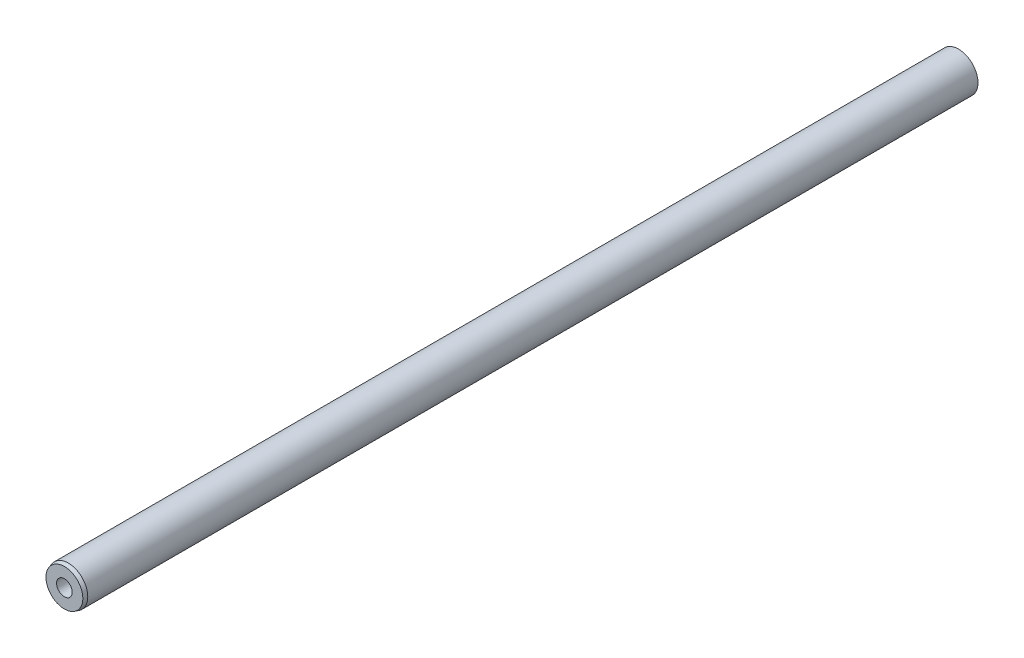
ISO-10303-21;
HEADER;
FILE_DESCRIPTION(('STEP AP214'),'2;1');
FILE_NAME('part.step','',(''),(''),'','','');
FILE_SCHEMA(('AUTOMOTIVE_DESIGN { 1 0 10303 214 1 1 1 1 }'));
ENDSEC;
DATA;
#1=APPLICATION_CONTEXT('core data for automotive mechanical design processes');
#2=APPLICATION_PROTOCOL_DEFINITION('international standard','automotive_design',2000,#1);
#3=PRODUCT_CONTEXT('',#1,'mechanical');
#4=PRODUCT('Part','Part','',(#3));
#5=PRODUCT_RELATED_PRODUCT_CATEGORY('part','',(#4));
#6=PRODUCT_DEFINITION_FORMATION('','',#4);
#7=PRODUCT_DEFINITION_CONTEXT('part definition',#1,'design');
#8=PRODUCT_DEFINITION('design','',#6,#7);
#9=PRODUCT_DEFINITION_SHAPE('','',#8);
#10=(LENGTH_UNIT() NAMED_UNIT(*) SI_UNIT(.MILLI.,.METRE.));
#11=(NAMED_UNIT(*) PLANE_ANGLE_UNIT() SI_UNIT($,.RADIAN.));
#12=(NAMED_UNIT(*) SI_UNIT($,.STERADIAN.) SOLID_ANGLE_UNIT());
#13=UNCERTAINTY_MEASURE_WITH_UNIT(LENGTH_MEASURE(1.E-05),#10,'distance_accuracy_value','');
#14=(GEOMETRIC_REPRESENTATION_CONTEXT(3) GLOBAL_UNCERTAINTY_ASSIGNED_CONTEXT((#13)) GLOBAL_UNIT_ASSIGNED_CONTEXT((#10,
#11,#12)) REPRESENTATION_CONTEXT('',''));
#15=CARTESIAN_POINT('',(0.,0.,0.));
#16=DIRECTION('',(0.,0.,1.));
#17=DIRECTION('',(1.,0.,0.));
#18=AXIS2_PLACEMENT_3D('',#15,#16,#17);
#19=CARTESIAN_POINT('',(0.,0.,291.4904));
#20=DIRECTION('',(0.,0.,-1.));
#21=DIRECTION('',(-1.,0.,0.));
#22=AXIS2_PLACEMENT_3D('',#19,#20,#21);
#23=CYLINDRICAL_SURFACE('',#22,6.34999999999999);
#24=CARTESIAN_POINT('',(0.,0.,290.2204));
#25=DIRECTION('',(0.,0.,1.));
#26=DIRECTION('',(1.,0.,0.));
#27=AXIS2_PLACEMENT_3D('',#24,#25,#26);
#28=CIRCLE('',#27,6.34999999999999);
#29=CARTESIAN_POINT('',(6.34999999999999,0.,290.2204));
#30=VERTEX_POINT('',#29);
#31=EDGE_CURVE('E11',#30,#30,#28,.F.);
#32=ORIENTED_EDGE('',*,*,#31,.T.);
#33=EDGE_LOOP('',(#32));
#34=FACE_BOUND('',#33,.T.);
#35=CARTESIAN_POINT('',(0.,0.,0.));
#36=DIRECTION('',(0.,0.,1.));
#37=DIRECTION('',(1.,0.,0.));
#38=AXIS2_PLACEMENT_3D('',#35,#36,#37);
#39=CIRCLE('',#38,6.34999999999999);
#40=CARTESIAN_POINT('',(6.34999999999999,0.,0.));
#41=VERTEX_POINT('',#40);
#42=EDGE_CURVE('E67',#41,#41,#39,.T.);
#43=ORIENTED_EDGE('',*,*,#42,.T.);
#44=EDGE_LOOP('',(#43));
#45=FACE_BOUND('',#44,.T.);
#46=ADVANCED_FACE('F45',(#34,#45),#23,.T.);
#47=CARTESIAN_POINT('',(0.,0.,291.4904));
#48=DIRECTION('',(0.,0.,1.));
#49=DIRECTION('',(1.,0.,0.));
#50=AXIS2_PLACEMENT_3D('',#47,#48,#49);
#51=PLANE('',#50);
#52=CARTESIAN_POINT('',(0.,0.,291.4904));
#53=DIRECTION('',(0.,0.,1.));
#54=DIRECTION('',(1.,0.,0.));
#55=AXIS2_PLACEMENT_3D('',#52,#53,#54);
#56=CIRCLE('',#55,2.552697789);
#57=CARTESIAN_POINT('',(2.552697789,0.,291.4904));
#58=VERTEX_POINT('',#57);
#59=EDGE_CURVE('E64',#58,#58,#56,.T.);
#60=ORIENTED_EDGE('',*,*,#59,.F.);
#61=EDGE_LOOP('',(#60));
#62=FACE_BOUND('',#61,.T.);
#63=CARTESIAN_POINT('',(0.,0.,291.4904));
#64=DIRECTION('',(0.,0.,1.));
#65=DIRECTION('',(1.,0.,0.));
#66=AXIS2_PLACEMENT_3D('',#63,#64,#65);
#67=CIRCLE('',#66,6.00970452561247);
#68=CARTESIAN_POINT('',(6.00970452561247,0.,291.4904));
#69=VERTEX_POINT('',#68);
#70=EDGE_CURVE('E52',#69,#69,#67,.T.);
#71=ORIENTED_EDGE('',*,*,#70,.T.);
#72=EDGE_LOOP('',(#71));
#73=FACE_BOUND('',#72,.T.);
#74=ADVANCED_FACE('F74',(#62,#73),#51,.T.);
#75=CARTESIAN_POINT('',(0.,0.,0.));
#76=DIRECTION('',(0.,0.,1.));
#77=DIRECTION('',(1.,0.,0.));
#78=AXIS2_PLACEMENT_3D('',#75,#76,#77);
#79=PLANE('',#78);
#80=ORIENTED_EDGE('',*,*,#42,.F.);
#81=EDGE_LOOP('',(#80));
#82=FACE_BOUND('',#81,.T.);
#83=ADVANCED_FACE('F77',(#82),#79,.F.);
#84=CARTESIAN_POINT('',(0.,0.,291.4904));
#85=DIRECTION('',(0.,0.,-1.));
#86=DIRECTION('',(-1.,0.,0.));
#87=AXIS2_PLACEMENT_3D('',#84,#85,#86);
#88=CONICAL_SURFACE('',#87,6.00970452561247,0.26179938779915);
#89=ORIENTED_EDGE('',*,*,#31,.F.);
#90=EDGE_LOOP('',(#89));
#91=FACE_BOUND('',#90,.T.);
#92=ORIENTED_EDGE('',*,*,#70,.F.);
#93=EDGE_LOOP('',(#92));
#94=FACE_BOUND('',#93,.T.);
#95=ADVANCED_FACE('F47',(#91,#94),#88,.T.);
#96=CARTESIAN_POINT('',(0.,0.,291.4904));
#97=DIRECTION('',(0.,0.,1.));
#98=DIRECTION('',(1.,0.,0.));
#99=AXIS2_PLACEMENT_3D('',#96,#97,#98);
#100=CYLINDRICAL_SURFACE('',#99,2.55269778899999);
#101=CARTESIAN_POINT('',(0.,0.,278.790411));
#102=DIRECTION('',(0.,0.,1.));
#103=DIRECTION('',(1.,0.,0.));
#104=AXIS2_PLACEMENT_3D('',#101,#102,#103);
#105=CIRCLE('',#104,2.55269778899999);
#106=CARTESIAN_POINT('',(2.55269778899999,0.,278.790411));
#107=VERTEX_POINT('',#106);
#108=EDGE_CURVE('E62',#107,#107,#105,.T.);
#109=ORIENTED_EDGE('',*,*,#108,.F.);
#110=EDGE_LOOP('',(#109));
#111=FACE_BOUND('',#110,.T.);
#112=ORIENTED_EDGE('',*,*,#59,.T.);
#113=EDGE_LOOP('',(#112));
#114=FACE_BOUND('',#113,.T.);
#115=ADVANCED_FACE('F58',(#111,#114),#100,.F.);
#116=CARTESIAN_POINT('',(0.,0.,278.790411));
#117=DIRECTION('',(0.,0.,1.));
#118=DIRECTION('',(1.,0.,0.));
#119=AXIS2_PLACEMENT_3D('',#116,#117,#118);
#120=CONICAL_SURFACE('',#119,2.55269778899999,1.02974425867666);
#121=CARTESIAN_POINT('',(0.,0.,277.256595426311));
#122=VERTEX_POINT('',#121);
#123=VERTEX_LOOP('',#122);
#124=FACE_BOUND('',#123,.T.);
#125=ORIENTED_EDGE('',*,*,#108,.T.);
#126=EDGE_LOOP('',(#125));
#127=FACE_BOUND('',#126,.T.);
#128=ADVANCED_FACE('F55',(#124,#127),#120,.F.);
#129=CLOSED_SHELL('',(#46,#74,#83,#95,#115,#128));
#130=MANIFOLD_SOLID_BREP('B2',#129);
#131=ADVANCED_BREP_SHAPE_REPRESENTATION('',(#18,#130),#14);
#132=SHAPE_DEFINITION_REPRESENTATION(#9,#131);
ENDSEC;
END-ISO-10303-21;
